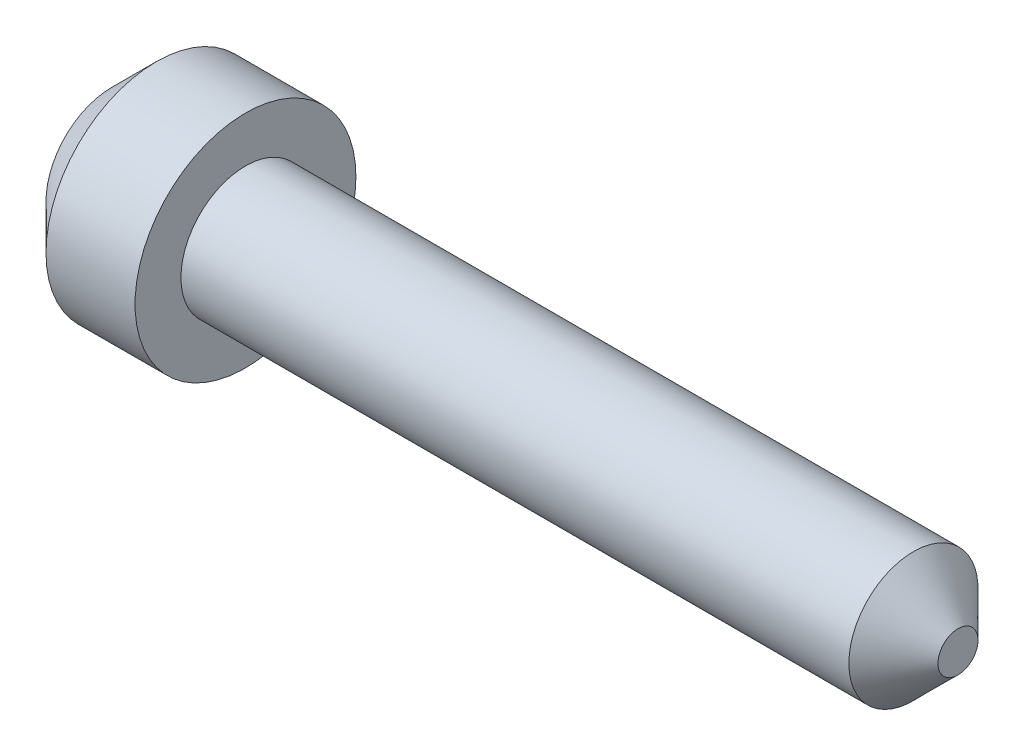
ISO-10303-21;
HEADER;
FILE_DESCRIPTION(('STEP AP214'),'2;1');
FILE_NAME('part.step','',(''),(''),'','','');
FILE_SCHEMA(('AUTOMOTIVE_DESIGN { 1 0 10303 214 1 1 1 1 }'));
ENDSEC;
DATA;
#1=APPLICATION_CONTEXT('core data for automotive mechanical design processes');
#2=APPLICATION_PROTOCOL_DEFINITION('international standard','automotive_design',2000,#1);
#3=PRODUCT_CONTEXT('',#1,'mechanical');
#4=PRODUCT('Part','Part','',(#3));
#5=PRODUCT_RELATED_PRODUCT_CATEGORY('part','',(#4));
#6=PRODUCT_DEFINITION_FORMATION('','',#4);
#7=PRODUCT_DEFINITION_CONTEXT('part definition',#1,'design');
#8=PRODUCT_DEFINITION('design','',#6,#7);
#9=PRODUCT_DEFINITION_SHAPE('','',#8);
#10=(LENGTH_UNIT() NAMED_UNIT(*) SI_UNIT(.MILLI.,.METRE.));
#11=(NAMED_UNIT(*) PLANE_ANGLE_UNIT() SI_UNIT($,.RADIAN.));
#12=(NAMED_UNIT(*) SI_UNIT($,.STERADIAN.) SOLID_ANGLE_UNIT());
#13=UNCERTAINTY_MEASURE_WITH_UNIT(LENGTH_MEASURE(1.E-05),#10,'distance_accuracy_value','');
#14=(GEOMETRIC_REPRESENTATION_CONTEXT(3) GLOBAL_UNCERTAINTY_ASSIGNED_CONTEXT((#13)) GLOBAL_UNIT_ASSIGNED_CONTEXT((#10,
#11,#12)) REPRESENTATION_CONTEXT('',''));
#15=CARTESIAN_POINT('',(0.,0.,0.));
#16=DIRECTION('',(0.,0.,1.));
#17=DIRECTION('',(1.,0.,0.));
#18=AXIS2_PLACEMENT_3D('',#15,#16,#17);
#19=CARTESIAN_POINT('',(0.,0.,0.));
#20=DIRECTION('',(1.,0.,0.));
#21=DIRECTION('',(0.,0.,-1.));
#22=AXIS2_PLACEMENT_3D('',#19,#20,#21);
#23=PLANE('',#22);
#24=CARTESIAN_POINT('',(0.,0.,0.));
#25=DIRECTION('',(1.,0.,0.));
#26=DIRECTION('',(0.,1.,0.));
#27=AXIS2_PLACEMENT_3D('',#24,#25,#26);
#28=CIRCLE('',#27,2.5061333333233);
#29=CARTESIAN_POINT('',(0.,2.5061333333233,0.));
#30=VERTEX_POINT('',#29);
#31=EDGE_CURVE('E17',#30,#30,#28,.T.);
#32=ORIENTED_EDGE('',*,*,#31,.F.);
#33=EDGE_LOOP('',(#32));
#34=FACE_BOUND('',#33,.T.);
#35=ADVANCED_FACE('F14',(#34),#23,.F.);
#36=CARTESIAN_POINT('',(1.69333333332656,0.,0.));
#37=DIRECTION('',(1.,0.,0.));
#38=DIRECTION('',(0.,1.,0.));
#39=AXIS2_PLACEMENT_3D('',#36,#37,#38);
#40=CONICAL_SURFACE('',#39,4.19946666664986,0.785398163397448);
#41=CARTESIAN_POINT('',(1.69333333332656,0.,0.));
#42=DIRECTION('',(1.,0.,0.));
#43=DIRECTION('',(0.,0.,-1.));
#44=AXIS2_PLACEMENT_3D('',#41,#42,#43);
#45=CIRCLE('',#44,4.19946666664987);
#46=CARTESIAN_POINT('',(1.69333333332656,0.,-4.19946666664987));
#47=VERTEX_POINT('',#46);
#48=EDGE_CURVE('E30',#47,#47,#45,.T.);
#49=ORIENTED_EDGE('',*,*,#48,.F.);
#50=EDGE_LOOP('',(#49));
#51=FACE_BOUND('',#50,.T.);
#52=ORIENTED_EDGE('',*,*,#31,.T.);
#53=EDGE_LOOP('',(#52));
#54=FACE_BOUND('',#53,.T.);
#55=ADVANCED_FACE('F43',(#51,#54),#40,.T.);
#56=CARTESIAN_POINT('',(32.1733333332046,0.,0.));
#57=DIRECTION('',(-1.,0.,0.));
#58=DIRECTION('',(0.,0.,1.));
#59=AXIS2_PLACEMENT_3D('',#56,#57,#58);
#60=PLANE('',#59);
#61=CARTESIAN_POINT('',(32.1733333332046,0.,0.));
#62=DIRECTION('',(-1.,0.,0.));
#63=DIRECTION('',(0.,0.,1.));
#64=AXIS2_PLACEMENT_3D('',#61,#62,#63);
#65=CIRCLE('',#64,0.761999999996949);
#66=CARTESIAN_POINT('',(32.1733333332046,0.,0.761999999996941));
#67=VERTEX_POINT('',#66);
#68=EDGE_CURVE('E33',#67,#67,#65,.T.);
#69=ORIENTED_EDGE('',*,*,#68,.F.);
#70=EDGE_LOOP('',(#69));
#71=FACE_BOUND('',#70,.T.);
#72=ADVANCED_FACE('F50',(#71),#60,.F.);
#73=CARTESIAN_POINT('',(0.,0.,0.));
#74=DIRECTION('',(1.,0.,0.));
#75=DIRECTION('',(0.,0.,-1.));
#76=AXIS2_PLACEMENT_3D('',#73,#74,#75);
#77=CYLINDRICAL_SURFACE('',#76,4.19946666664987);
#78=CARTESIAN_POINT('',(5.07999999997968,0.,0.));
#79=DIRECTION('',(1.,0.,0.));
#80=DIRECTION('',(0.,0.,-1.));
#81=AXIS2_PLACEMENT_3D('',#78,#79,#80);
#82=CIRCLE('',#81,4.19946666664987);
#83=CARTESIAN_POINT('',(5.07999999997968,0.,-4.19946666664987));
#84=VERTEX_POINT('',#83);
#85=EDGE_CURVE('E26',#84,#84,#82,.T.);
#86=ORIENTED_EDGE('',*,*,#85,.F.);
#87=EDGE_LOOP('',(#86));
#88=FACE_BOUND('',#87,.T.);
#89=ORIENTED_EDGE('',*,*,#48,.T.);
#90=EDGE_LOOP('',(#89));
#91=FACE_BOUND('',#90,.T.);
#92=ADVANCED_FACE('F66',(#88,#91),#77,.T.);
#93=CARTESIAN_POINT('',(30.4799999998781,0.,0.));
#94=DIRECTION('',(-1.,0.,0.));
#95=DIRECTION('',(0.,0.,1.));
#96=AXIS2_PLACEMENT_3D('',#93,#94,#95);
#97=CONICAL_SURFACE('',#96,2.45533333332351,0.785398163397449);
#98=CARTESIAN_POINT('',(30.4799999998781,0.,0.));
#99=DIRECTION('',(-1.,0.,0.));
#100=DIRECTION('',(0.,0.,1.));
#101=AXIS2_PLACEMENT_3D('',#98,#99,#100);
#102=CIRCLE('',#101,2.45533333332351);
#103=CARTESIAN_POINT('',(30.4799999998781,0.,2.4553333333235));
#104=VERTEX_POINT('',#103);
#105=EDGE_CURVE('E21',#104,#104,#102,.T.);
#106=CARTESIAN_POINT('',(32.1733333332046,0.,0.761999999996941));
#107=CARTESIAN_POINT('',(32.1556944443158,0.,0.77963888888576));
#108=CARTESIAN_POINT('',(32.138055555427,0.,0.797277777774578));
#109=CARTESIAN_POINT('',(32.1027777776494,0.,0.832555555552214));
#110=CARTESIAN_POINT('',(32.0851388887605,0.,0.850194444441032));
#111=CARTESIAN_POINT('',(32.0498611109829,0.,0.885472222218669));
#112=CARTESIAN_POINT('',(32.0322222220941,0.,0.903111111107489));
#113=CARTESIAN_POINT('',(31.9969444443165,0.,0.938388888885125));
#114=CARTESIAN_POINT('',(31.9793055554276,0.,0.956027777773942));
#115=CARTESIAN_POINT('',(31.94402777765,0.,0.991305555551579));
#116=CARTESIAN_POINT('',(31.9263888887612,0.,1.0089444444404));
#117=CARTESIAN_POINT('',(31.8911111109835,0.,1.04422222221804));
#118=CARTESIAN_POINT('',(31.8734722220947,0.,1.06186111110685));
#119=CARTESIAN_POINT('',(31.8381944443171,0.,1.09713888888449));
#120=CARTESIAN_POINT('',(31.8205555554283,0.,1.11477777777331));
#121=CARTESIAN_POINT('',(31.7852777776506,0.,1.15005555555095));
#122=CARTESIAN_POINT('',(31.7676388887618,0.,1.16769444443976));
#123=CARTESIAN_POINT('',(31.7323611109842,0.,1.2029722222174));
#124=CARTESIAN_POINT('',(31.7147222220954,0.,1.22061111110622));
#125=CARTESIAN_POINT('',(31.6794444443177,0.,1.25588888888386));
#126=CARTESIAN_POINT('',(31.6618055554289,0.,1.27352777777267));
#127=CARTESIAN_POINT('',(31.6265277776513,0.,1.30880555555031));
#128=CARTESIAN_POINT('',(31.6088888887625,0.,1.32644444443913));
#129=CARTESIAN_POINT('',(31.5736111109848,0.,1.36172222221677));
#130=CARTESIAN_POINT('',(31.555972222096,0.,1.37936111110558));
#131=CARTESIAN_POINT('',(31.5206944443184,0.,1.41463888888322));
#132=CARTESIAN_POINT('',(31.5030555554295,0.,1.43227777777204));
#133=CARTESIAN_POINT('',(31.4677777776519,0.,1.46755555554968));
#134=CARTESIAN_POINT('',(31.4501388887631,0.,1.48519444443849));
#135=CARTESIAN_POINT('',(31.4148611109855,0.,1.52047222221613));
#136=CARTESIAN_POINT('',(31.3972222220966,0.,1.53811111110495));
#137=CARTESIAN_POINT('',(31.361944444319,0.,1.57338888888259));
#138=CARTESIAN_POINT('',(31.3443055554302,0.,1.5910277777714));
#139=CARTESIAN_POINT('',(31.3090277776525,0.,1.62630555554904));
#140=CARTESIAN_POINT('',(31.2913888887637,0.,1.64394444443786));
#141=CARTESIAN_POINT('',(31.2561111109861,0.,1.6792222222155));
#142=CARTESIAN_POINT('',(31.2384722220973,0.,1.69686111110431));
#143=CARTESIAN_POINT('',(31.2031944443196,0.,1.73213888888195));
#144=CARTESIAN_POINT('',(31.1855555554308,0.,1.74977777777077));
#145=CARTESIAN_POINT('',(31.1502777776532,0.,1.78505555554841));
#146=CARTESIAN_POINT('',(31.1326388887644,0.,1.80269444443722));
#147=CARTESIAN_POINT('',(31.0973611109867,0.,1.83797222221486));
#148=CARTESIAN_POINT('',(31.0797222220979,0.,1.85561111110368));
#149=CARTESIAN_POINT('',(31.0444444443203,0.,1.89088888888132));
#150=CARTESIAN_POINT('',(31.0268055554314,0.,1.90852777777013));
#151=CARTESIAN_POINT('',(30.9915277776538,0.,1.94380555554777));
#152=CARTESIAN_POINT('',(30.973888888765,0.,1.96144444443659));
#153=CARTESIAN_POINT('',(30.9386111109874,0.,1.99672222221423));
#154=CARTESIAN_POINT('',(30.9209722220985,0.,2.01436111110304));
#155=CARTESIAN_POINT('',(30.8856944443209,0.,2.04963888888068));
#156=CARTESIAN_POINT('',(30.8680555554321,0.,2.0672777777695));
#157=CARTESIAN_POINT('',(30.8327777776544,0.,2.10255555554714));
#158=CARTESIAN_POINT('',(30.8151388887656,0.,2.12019444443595));
#159=CARTESIAN_POINT('',(30.779861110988,0.,2.15547222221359));
#160=CARTESIAN_POINT('',(30.7622222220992,0.,2.17311111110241));
#161=CARTESIAN_POINT('',(30.7269444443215,0.,2.20838888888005));
#162=CARTESIAN_POINT('',(30.7093055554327,0.,2.22602777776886));
#163=CARTESIAN_POINT('',(30.6740277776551,0.,2.2613055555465));
#164=CARTESIAN_POINT('',(30.6563888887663,0.,2.27894444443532));
#165=CARTESIAN_POINT('',(30.6211111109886,0.,2.31422222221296));
#166=CARTESIAN_POINT('',(30.6034722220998,0.,2.33186111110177));
#167=CARTESIAN_POINT('',(30.5681944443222,0.,2.36713888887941));
#168=CARTESIAN_POINT('',(30.5505555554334,0.,2.38477777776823));
#169=CARTESIAN_POINT('',(30.5152777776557,0.,2.42005555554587));
#170=CARTESIAN_POINT('',(30.4976388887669,0.,2.43769444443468));
#171=CARTESIAN_POINT('',(30.4799999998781,0.,2.4553333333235));
#172=B_SPLINE_CURVE_WITH_KNOTS('',3,(#106,#107,#108,#109,#110,#111,#112,#113,#114,#115,#116,
#117,#118,#119,#120,#121,#122,#123,#124,#125,#126,#127,#128,#129,#130,#131,#132,#133,#134,#135,
#136,#137,#138,#139,#140,#141,#142,#143,#144,#145,#146,#147,#148,#149,#150,#151,#152,#153,#154,
#155,#156,#157,#158,#159,#160,#161,#162,#163,#164,#165,#166,#167,#168,#169,#170,#171),
.UNSPECIFIED.,.F.,.F.,(4,2,2,2,2,2,2,2,2,2,2,2,2,2,2,2,2,2,2,2,2,2,2,2,2,2,2,2,2,2,2,2,4),(0.,
0.0748354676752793,0.149670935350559,0.224506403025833,0.299341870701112,0.374177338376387,
0.449012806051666,0.52384827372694,0.598683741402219,0.673519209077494,0.748354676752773,
0.823190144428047,0.898025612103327,0.972861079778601,1.04769654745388,1.12253201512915,
1.19736748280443,1.27220295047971,1.34703841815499,1.42187388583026,1.49670935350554,
1.57154482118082,1.64638028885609,1.72121575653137,1.79605122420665,1.87088669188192,
1.9457221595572,2.02055762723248,2.09539309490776,2.17022856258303,2.24506403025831,
2.31989949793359,2.39473496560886),.UNSPECIFIED.);
#173=EDGE_CURVE('BSEAM60',#67,#104,#172,.T.);
#174=ORIENTED_EDGE('',*,*,#68,.T.);
#175=ORIENTED_EDGE('',*,*,#105,.F.);
#176=ORIENTED_EDGE('',*,*,#173,.T.);
#177=ORIENTED_EDGE('',*,*,#173,.F.);
#178=EDGE_LOOP('',(#174,#176,#175,#177));
#179=FACE_BOUND('',#178,.T.);
#180=ADVANCED_FACE('F60',(#179),#97,.T.);
#181=CARTESIAN_POINT('',(5.07999999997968,0.,0.));
#182=DIRECTION('',(1.,0.,0.));
#183=DIRECTION('',(0.,0.,-1.));
#184=AXIS2_PLACEMENT_3D('',#181,#182,#183);
#185=PLANE('',#184);
#186=CARTESIAN_POINT('',(5.07999999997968,0.,0.));
#187=DIRECTION('',(-1.,0.,0.));
#188=DIRECTION('',(0.,0.,1.));
#189=AXIS2_PLACEMENT_3D('',#186,#187,#188);
#190=CIRCLE('',#189,2.45533333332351);
#191=CARTESIAN_POINT('',(5.07999999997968,0.,2.45533333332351));
#192=VERTEX_POINT('',#191);
#193=EDGE_CURVE('E10',#192,#192,#190,.F.);
#194=ORIENTED_EDGE('',*,*,#193,.F.);
#195=EDGE_LOOP('',(#194));
#196=FACE_BOUND('',#195,.T.);
#197=ORIENTED_EDGE('',*,*,#85,.T.);
#198=EDGE_LOOP('',(#197));
#199=FACE_BOUND('',#198,.T.);
#200=ADVANCED_FACE('F54',(#196,#199),#185,.T.);
#201=CARTESIAN_POINT('',(33.5279999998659,0.,0.));
#202=DIRECTION('',(-1.,0.,0.));
#203=DIRECTION('',(0.,0.,1.));
#204=AXIS2_PLACEMENT_3D('',#201,#202,#203);
#205=CYLINDRICAL_SURFACE('',#204,2.45533333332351);
#206=ORIENTED_EDGE('',*,*,#105,.T.);
#207=EDGE_LOOP('',(#206));
#208=FACE_BOUND('',#207,.T.);
#209=ORIENTED_EDGE('',*,*,#193,.T.);
#210=EDGE_LOOP('',(#209));
#211=FACE_BOUND('',#210,.T.);
#212=ADVANCED_FACE('F52',(#208,#211),#205,.T.);
#213=CLOSED_SHELL('',(#35,#55,#72,#92,#180,#200,#212));
#214=MANIFOLD_SOLID_BREP('B1',#213);
#215=ADVANCED_BREP_SHAPE_REPRESENTATION('',(#18,#214),#14);
#216=SHAPE_DEFINITION_REPRESENTATION(#9,#215);
ENDSEC;
END-ISO-10303-21;
